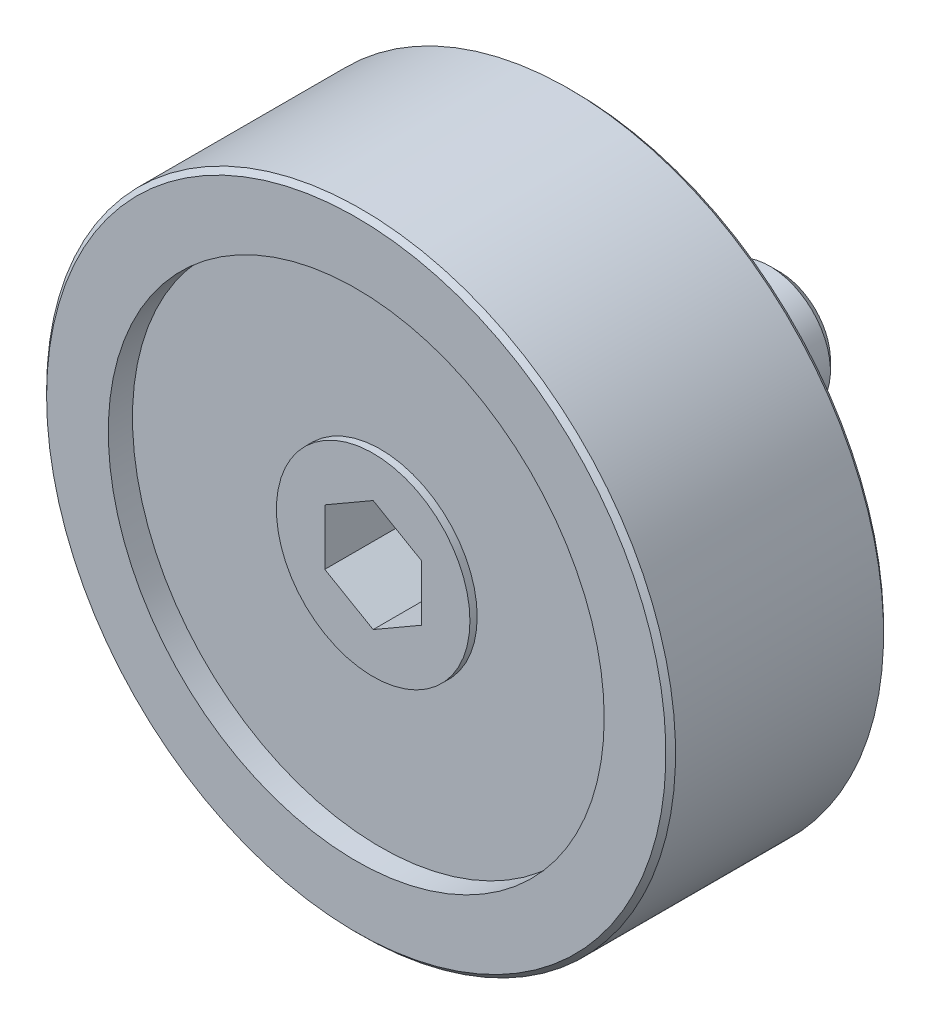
ISO-10303-21;
HEADER;
FILE_DESCRIPTION(('STEP AP214'),'2;1');
FILE_NAME('part.step','',(''),(''),'','','');
FILE_SCHEMA(('AUTOMOTIVE_DESIGN { 1 0 10303 214 1 1 1 1 }'));
ENDSEC;
DATA;
#1=APPLICATION_CONTEXT('core data for automotive mechanical design processes');
#2=APPLICATION_PROTOCOL_DEFINITION('international standard','automotive_design',2000,#1);
#3=PRODUCT_CONTEXT('',#1,'mechanical');
#4=PRODUCT('Part','Part','',(#3));
#5=PRODUCT_RELATED_PRODUCT_CATEGORY('part','',(#4));
#6=PRODUCT_DEFINITION_FORMATION('','',#4);
#7=PRODUCT_DEFINITION_CONTEXT('part definition',#1,'design');
#8=PRODUCT_DEFINITION('design','',#6,#7);
#9=PRODUCT_DEFINITION_SHAPE('','',#8);
#10=(LENGTH_UNIT() NAMED_UNIT(*) SI_UNIT(.MILLI.,.METRE.));
#11=(NAMED_UNIT(*) PLANE_ANGLE_UNIT() SI_UNIT($,.RADIAN.));
#12=(NAMED_UNIT(*) SI_UNIT($,.STERADIAN.) SOLID_ANGLE_UNIT());
#13=UNCERTAINTY_MEASURE_WITH_UNIT(LENGTH_MEASURE(1.E-05),#10,'distance_accuracy_value','');
#14=(GEOMETRIC_REPRESENTATION_CONTEXT(3) GLOBAL_UNCERTAINTY_ASSIGNED_CONTEXT((#13)) GLOBAL_UNIT_ASSIGNED_CONTEXT((#10,
#11,#12)) REPRESENTATION_CONTEXT('',''));
#15=CARTESIAN_POINT('',(0.,0.,0.));
#16=DIRECTION('',(0.,0.,1.));
#17=DIRECTION('',(1.,0.,0.));
#18=AXIS2_PLACEMENT_3D('',#15,#16,#17);
#19=CARTESIAN_POINT('',(0.,0.,1.2));
#20=DIRECTION('',(0.,0.,-1.));
#21=DIRECTION('',(-1.,0.,0.));
#22=AXIS2_PLACEMENT_3D('',#19,#20,#21);
#23=CYLINDRICAL_SURFACE('',#22,2.5);
#24=CARTESIAN_POINT('',(0.,0.,-7.1));
#25=DIRECTION('',(0.,0.,-1.));
#26=DIRECTION('',(-1.,0.,0.));
#27=AXIS2_PLACEMENT_3D('',#24,#25,#26);
#28=CIRCLE('',#27,2.5);
#29=CARTESIAN_POINT('',(-2.5,0.,-7.1));
#30=VERTEX_POINT('',#29);
#31=EDGE_CURVE('E9',#30,#30,#28,.F.);
#32=ORIENTED_EDGE('',*,*,#31,.T.);
#33=EDGE_LOOP('',(#32));
#34=FACE_BOUND('',#33,.T.);
#35=CARTESIAN_POINT('',(0.,0.,-1.1));
#36=DIRECTION('',(0.,0.,1.));
#37=DIRECTION('',(1.,0.,0.));
#38=AXIS2_PLACEMENT_3D('',#35,#36,#37);
#39=CIRCLE('',#38,2.5);
#40=CARTESIAN_POINT('',(2.5,0.,-1.1));
#41=VERTEX_POINT('',#40);
#42=EDGE_CURVE('E76',#41,#41,#39,.T.);
#43=ORIENTED_EDGE('',*,*,#42,.F.);
#44=EDGE_LOOP('',(#43));
#45=FACE_BOUND('',#44,.T.);
#46=ADVANCED_FACE('F14',(#34,#45),#23,.T.);
#47=CARTESIAN_POINT('',(0.,0.,1.2));
#48=DIRECTION('',(0.,0.,-1.));
#49=DIRECTION('',(-1.,0.,0.));
#50=AXIS2_PLACEMENT_3D('',#47,#48,#49);
#51=CYLINDRICAL_SURFACE('',#50,5.);
#52=CARTESIAN_POINT('',(0.,0.,2.));
#53=DIRECTION('',(0.,0.,-1.));
#54=DIRECTION('',(-1.,0.,0.));
#55=AXIS2_PLACEMENT_3D('',#52,#53,#54);
#56=CIRCLE('',#55,5.);
#57=CARTESIAN_POINT('',(-5.,0.,2.));
#58=VERTEX_POINT('',#57);
#59=EDGE_CURVE('E112',#58,#58,#56,.F.);
#60=ORIENTED_EDGE('',*,*,#59,.F.);
#61=EDGE_LOOP('',(#60));
#62=FACE_BOUND('',#61,.T.);
#63=CARTESIAN_POINT('',(0.,0.,0.5));
#64=DIRECTION('',(0.,0.,-1.));
#65=DIRECTION('',(-1.,0.,0.));
#66=AXIS2_PLACEMENT_3D('',#63,#64,#65);
#67=CIRCLE('',#66,5.);
#68=CARTESIAN_POINT('',(-5.,0.,0.5));
#69=VERTEX_POINT('',#68);
#70=EDGE_CURVE('E109',#69,#69,#67,.T.);
#71=ORIENTED_EDGE('',*,*,#70,.F.);
#72=EDGE_LOOP('',(#71));
#73=FACE_BOUND('',#72,.T.);
#74=ADVANCED_FACE('F163',(#62,#73),#51,.T.);
#75=CARTESIAN_POINT('',(0.,14.8,10.));
#76=DIRECTION('',(0.,0.,1.));
#77=DIRECTION('',(1.,0.,0.));
#78=AXIS2_PLACEMENT_3D('',#75,#76,#77);
#79=PLANE('',#78);
#80=CARTESIAN_POINT('',(0.,0.,10.));
#81=DIRECTION('',(0.,0.,1.));
#82=DIRECTION('',(1.,0.,0.));
#83=AXIS2_PLACEMENT_3D('',#80,#81,#82);
#84=CIRCLE('',#83,10.25);
#85=CARTESIAN_POINT('',(10.25,0.,10.));
#86=VERTEX_POINT('',#85);
#87=EDGE_CURVE('E127',#86,#86,#84,.T.);
#88=ORIENTED_EDGE('',*,*,#87,.F.);
#89=EDGE_LOOP('',(#88));
#90=FACE_BOUND('',#89,.T.);
#91=CARTESIAN_POINT('',(0.,0.,9.99999999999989));
#92=DIRECTION('',(0.,0.,-1.));
#93=DIRECTION('',(-1.,0.,0.));
#94=AXIS2_PLACEMENT_3D('',#91,#92,#93);
#95=CIRCLE('',#94,12.8);
#96=CARTESIAN_POINT('',(-12.8,0.,9.99999999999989));
#97=VERTEX_POINT('',#96);
#98=EDGE_CURVE('E124',#97,#97,#95,.T.);
#99=ORIENTED_EDGE('',*,*,#98,.F.);
#100=EDGE_LOOP('',(#99));
#101=FACE_BOUND('',#100,.T.);
#102=ADVANCED_FACE('F169',(#90,#101),#79,.T.);
#103=CARTESIAN_POINT('',(0.,4.00000000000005,9.3));
#104=DIRECTION('',(0.,0.,1.));
#105=DIRECTION('',(1.,0.,0.));
#106=AXIS2_PLACEMENT_3D('',#103,#104,#105);
#107=PLANE('',#106);
#108=CARTESIAN_POINT('',(0.,0.,9.3));
#109=DIRECTION('',(0.,0.,1.));
#110=DIRECTION('',(1.,0.,0.));
#111=AXIS2_PLACEMENT_3D('',#108,#109,#110);
#112=CIRCLE('',#111,4.00000000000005);
#113=CARTESIAN_POINT('',(4.00000000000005,0.,9.3));
#114=VERTEX_POINT('',#113);
#115=EDGE_CURVE('E136',#114,#114,#112,.T.);
#116=ORIENTED_EDGE('',*,*,#115,.T.);
#117=EDGE_LOOP('',(#116));
#118=FACE_BOUND('',#117,.T.);
#119=DIRECTION('',(0.866025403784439,-0.5,0.));
#120=VECTOR('',#119,1.);
#121=CARTESIAN_POINT('',(-2.,-1.15470053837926,9.3));
#122=LINE('',#121,#120);
#123=CARTESIAN_POINT('',(-2.,-1.15470053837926,9.3));
#124=VERTEX_POINT('',#123);
#125=CARTESIAN_POINT('',(0.,-2.30940107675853,9.3));
#126=VERTEX_POINT('',#125);
#127=EDGE_CURVE('E71',#124,#126,#122,.T.);
#128=ORIENTED_EDGE('',*,*,#127,.F.);
#129=DIRECTION('',(0.,-1.,0.));
#130=VECTOR('',#129,1.);
#131=CARTESIAN_POINT('',(-2.,1.15470053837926,9.3));
#132=LINE('',#131,#130);
#133=CARTESIAN_POINT('',(-2.,1.15470053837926,9.3));
#134=VERTEX_POINT('',#133);
#135=EDGE_CURVE('E65',#134,#124,#132,.T.);
#136=ORIENTED_EDGE('',*,*,#135,.F.);
#137=DIRECTION('',(-0.866025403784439,-0.5,0.));
#138=VECTOR('',#137,1.);
#139=CARTESIAN_POINT('',(0.,2.30940107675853,9.3));
#140=LINE('',#139,#138);
#141=CARTESIAN_POINT('',(0.,2.30940107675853,9.3));
#142=VERTEX_POINT('',#141);
#143=EDGE_CURVE('E68',#142,#134,#140,.T.);
#144=ORIENTED_EDGE('',*,*,#143,.F.);
#145=DIRECTION('',(-0.866025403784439,0.5,0.));
#146=VECTOR('',#145,1.);
#147=CARTESIAN_POINT('',(2.,1.15470053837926,9.3));
#148=LINE('',#147,#146);
#149=CARTESIAN_POINT('',(2.,1.15470053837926,9.3));
#150=VERTEX_POINT('',#149);
#151=EDGE_CURVE('E85',#150,#142,#148,.T.);
#152=ORIENTED_EDGE('',*,*,#151,.F.);
#153=DIRECTION('',(0.,1.,0.));
#154=VECTOR('',#153,1.);
#155=CARTESIAN_POINT('',(2.,-1.15470053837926,9.3));
#156=LINE('',#155,#154);
#157=CARTESIAN_POINT('',(2.,-1.15470053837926,9.3));
#158=VERTEX_POINT('',#157);
#159=EDGE_CURVE('E410',#158,#150,#156,.T.);
#160=ORIENTED_EDGE('',*,*,#159,.F.);
#161=DIRECTION('',(0.866025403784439,0.5,0.));
#162=VECTOR('',#161,1.);
#163=CARTESIAN_POINT('',(0.,-2.30940107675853,9.3));
#164=LINE('',#163,#162);
#165=EDGE_CURVE('E412',#126,#158,#164,.T.);
#166=ORIENTED_EDGE('',*,*,#165,.F.);
#167=EDGE_LOOP('',(#128,#136,#144,#152,#160,#166));
#168=FACE_BOUND('',#167,.T.);
#169=ADVANCED_FACE('F67',(#118,#168),#107,.T.);
#170=CARTESIAN_POINT('',(0.,0.,13.));
#171=DIRECTION('',(0.,0.,1.));
#172=DIRECTION('',(1.,0.,0.));
#173=AXIS2_PLACEMENT_3D('',#170,#171,#172);
#174=CYLINDRICAL_SURFACE('',#173,4.00000000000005);
#175=CARTESIAN_POINT('',(0.,0.,9.));
#176=DIRECTION('',(0.,0.,1.));
#177=DIRECTION('',(1.,0.,0.));
#178=AXIS2_PLACEMENT_3D('',#175,#176,#177);
#179=CIRCLE('',#178,4.00000000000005);
#180=CARTESIAN_POINT('',(4.00000000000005,0.,9.));
#181=VERTEX_POINT('',#180);
#182=EDGE_CURVE('E133',#181,#181,#179,.T.);
#183=ORIENTED_EDGE('',*,*,#182,.T.);
#184=EDGE_LOOP('',(#183));
#185=FACE_BOUND('',#184,.T.);
#186=ORIENTED_EDGE('',*,*,#115,.F.);
#187=EDGE_LOOP('',(#186));
#188=FACE_BOUND('',#187,.T.);
#189=ADVANCED_FACE('F193',(#185,#188),#174,.T.);
#190=CARTESIAN_POINT('',(0.,10.25,9.));
#191=DIRECTION('',(0.,0.,1.));
#192=DIRECTION('',(1.,0.,0.));
#193=AXIS2_PLACEMENT_3D('',#190,#191,#192);
#194=PLANE('',#193);
#195=CARTESIAN_POINT('',(0.,0.,9.));
#196=DIRECTION('',(0.,0.,1.));
#197=DIRECTION('',(1.,0.,0.));
#198=AXIS2_PLACEMENT_3D('',#195,#196,#197);
#199=CIRCLE('',#198,10.25);
#200=CARTESIAN_POINT('',(10.25,0.,9.));
#201=VERTEX_POINT('',#200);
#202=EDGE_CURVE('E130',#201,#201,#199,.T.);
#203=ORIENTED_EDGE('',*,*,#202,.T.);
#204=EDGE_LOOP('',(#203));
#205=FACE_BOUND('',#204,.T.);
#206=ORIENTED_EDGE('',*,*,#182,.F.);
#207=EDGE_LOOP('',(#206));
#208=FACE_BOUND('',#207,.T.);
#209=ADVANCED_FACE('F189',(#205,#208),#194,.T.);
#210=CARTESIAN_POINT('',(0.,0.,13.));
#211=DIRECTION('',(0.,0.,1.));
#212=DIRECTION('',(1.,0.,0.));
#213=AXIS2_PLACEMENT_3D('',#210,#211,#212);
#214=CYLINDRICAL_SURFACE('',#213,10.25);
#215=ORIENTED_EDGE('',*,*,#87,.T.);
#216=EDGE_LOOP('',(#215));
#217=FACE_BOUND('',#216,.T.);
#218=ORIENTED_EDGE('',*,*,#202,.F.);
#219=EDGE_LOOP('',(#218));
#220=FACE_BOUND('',#219,.T.);
#221=ADVANCED_FACE('F186',(#217,#220),#214,.F.);
#222=CARTESIAN_POINT('',(0.,0.,9.99999999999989));
#223=DIRECTION('',(0.,0.,-1.));
#224=DIRECTION('',(-1.,0.,0.));
#225=AXIS2_PLACEMENT_3D('',#222,#223,#224);
#226=CONICAL_SURFACE('',#225,12.8,0.785398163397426);
#227=CARTESIAN_POINT('',(0.,0.,9.79999999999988));
#228=DIRECTION('',(0.,0.,-1.));
#229=DIRECTION('',(-1.,0.,0.));
#230=AXIS2_PLACEMENT_3D('',#227,#228,#229);
#231=CIRCLE('',#230,13.);
#232=CARTESIAN_POINT('',(-13.,0.,9.79999999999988));
#233=VERTEX_POINT('',#232);
#234=EDGE_CURVE('E121',#233,#233,#231,.T.);
#235=ORIENTED_EDGE('',*,*,#234,.F.);
#236=EDGE_LOOP('',(#235));
#237=FACE_BOUND('',#236,.T.);
#238=ORIENTED_EDGE('',*,*,#98,.T.);
#239=EDGE_LOOP('',(#238));
#240=FACE_BOUND('',#239,.T.);
#241=ADVANCED_FACE('F175',(#237,#240),#226,.T.);
#242=CARTESIAN_POINT('',(0.,0.,1.2));
#243=DIRECTION('',(0.,0.,-1.));
#244=DIRECTION('',(-1.,0.,0.));
#245=AXIS2_PLACEMENT_3D('',#242,#243,#244);
#246=CYLINDRICAL_SURFACE('',#245,13.);
#247=CARTESIAN_POINT('',(0.,0.,1.2));
#248=DIRECTION('',(0.,0.,-1.));
#249=DIRECTION('',(-1.,0.,0.));
#250=AXIS2_PLACEMENT_3D('',#247,#248,#249);
#251=CIRCLE('',#250,13.);
#252=CARTESIAN_POINT('',(-13.,0.,1.2));
#253=VERTEX_POINT('',#252);
#254=EDGE_CURVE('E118',#253,#253,#251,.T.);
#255=ORIENTED_EDGE('',*,*,#254,.F.);
#256=EDGE_LOOP('',(#255));
#257=FACE_BOUND('',#256,.T.);
#258=ORIENTED_EDGE('',*,*,#234,.T.);
#259=EDGE_LOOP('',(#258));
#260=FACE_BOUND('',#259,.T.);
#261=ADVANCED_FACE('F222',(#257,#260),#246,.T.);
#262=CARTESIAN_POINT('',(0.,0.,1.2));
#263=DIRECTION('',(0.,0.,1.));
#264=DIRECTION('',(1.,0.,0.));
#265=AXIS2_PLACEMENT_3D('',#262,#263,#264);
#266=CONICAL_SURFACE('',#265,13.,0.785398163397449);
#267=CARTESIAN_POINT('',(0.,0.,1.));
#268=DIRECTION('',(0.,0.,-1.));
#269=DIRECTION('',(-1.,0.,0.));
#270=AXIS2_PLACEMENT_3D('',#267,#268,#269);
#271=CIRCLE('',#270,12.8);
#272=CARTESIAN_POINT('',(-12.8,0.,1.));
#273=VERTEX_POINT('',#272);
#274=EDGE_CURVE('E115',#273,#273,#271,.T.);
#275=ORIENTED_EDGE('',*,*,#274,.F.);
#276=EDGE_LOOP('',(#275));
#277=FACE_BOUND('',#276,.T.);
#278=ORIENTED_EDGE('',*,*,#254,.T.);
#279=EDGE_LOOP('',(#278));
#280=FACE_BOUND('',#279,.T.);
#281=ADVANCED_FACE('F205',(#277,#280),#266,.T.);
#282=CARTESIAN_POINT('',(0.,5.1,2.));
#283=DIRECTION('',(0.,0.,-1.));
#284=DIRECTION('',(-1.,0.,0.));
#285=AXIS2_PLACEMENT_3D('',#282,#283,#284);
#286=PLANE('',#285);
#287=CARTESIAN_POINT('',(0.,0.,2.));
#288=DIRECTION('',(0.,0.,1.));
#289=DIRECTION('',(1.,0.,0.));
#290=AXIS2_PLACEMENT_3D('',#287,#288,#289);
#291=CIRCLE('',#290,10.25);
#292=CARTESIAN_POINT('',(10.25,0.,2.));
#293=VERTEX_POINT('',#292);
#294=EDGE_CURVE('E139',#293,#293,#291,.T.);
#295=ORIENTED_EDGE('',*,*,#294,.F.);
#296=EDGE_LOOP('',(#295));
#297=FACE_BOUND('',#296,.T.);
#298=ORIENTED_EDGE('',*,*,#59,.T.);
#299=EDGE_LOOP('',(#298));
#300=FACE_BOUND('',#299,.T.);
#301=ADVANCED_FACE('F201',(#297,#300),#286,.T.);
#302=CARTESIAN_POINT('',(0.,0.,13.));
#303=DIRECTION('',(0.,0.,1.));
#304=DIRECTION('',(1.,0.,0.));
#305=AXIS2_PLACEMENT_3D('',#302,#303,#304);
#306=CYLINDRICAL_SURFACE('',#305,10.25);
#307=ORIENTED_EDGE('',*,*,#294,.T.);
#308=EDGE_LOOP('',(#307));
#309=FACE_BOUND('',#308,.T.);
#310=CARTESIAN_POINT('',(0.,0.,1.));
#311=DIRECTION('',(0.,0.,1.));
#312=DIRECTION('',(1.,0.,0.));
#313=AXIS2_PLACEMENT_3D('',#310,#311,#312);
#314=CIRCLE('',#313,10.25);
#315=CARTESIAN_POINT('',(10.25,0.,1.));
#316=VERTEX_POINT('',#315);
#317=EDGE_CURVE('E142',#316,#316,#314,.T.);
#318=ORIENTED_EDGE('',*,*,#317,.F.);
#319=EDGE_LOOP('',(#318));
#320=FACE_BOUND('',#319,.T.);
#321=ADVANCED_FACE('F204',(#309,#320),#306,.F.);
#322=CARTESIAN_POINT('',(0.,14.8,1.));
#323=DIRECTION('',(0.,0.,-1.));
#324=DIRECTION('',(-1.,0.,0.));
#325=AXIS2_PLACEMENT_3D('',#322,#323,#324);
#326=PLANE('',#325);
#327=ORIENTED_EDGE('',*,*,#317,.T.);
#328=EDGE_LOOP('',(#327));
#329=FACE_BOUND('',#328,.T.);
#330=ORIENTED_EDGE('',*,*,#274,.T.);
#331=EDGE_LOOP('',(#330));
#332=FACE_BOUND('',#331,.T.);
#333=ADVANCED_FACE('F209',(#329,#332),#326,.T.);
#334=CARTESIAN_POINT('',(0.,0.,0.5));
#335=DIRECTION('',(0.,0.,-1.));
#336=DIRECTION('',(-1.,0.,0.));
#337=AXIS2_PLACEMENT_3D('',#334,#335,#336);
#338=PLANE('',#337);
#339=CARTESIAN_POINT('',(0.,0.,0.5));
#340=DIRECTION('',(0.,0.,-1.));
#341=DIRECTION('',(-1.,0.,0.));
#342=AXIS2_PLACEMENT_3D('',#339,#340,#341);
#343=CIRCLE('',#342,2.);
#344=CARTESIAN_POINT('',(-2.,0.,0.5));
#345=VERTEX_POINT('',#344);
#346=EDGE_CURVE('E106',#345,#345,#343,.T.);
#347=ORIENTED_EDGE('',*,*,#346,.F.);
#348=EDGE_LOOP('',(#347));
#349=FACE_BOUND('',#348,.T.);
#350=ORIENTED_EDGE('',*,*,#70,.T.);
#351=EDGE_LOOP('',(#350));
#352=FACE_BOUND('',#351,.T.);
#353=ADVANCED_FACE('F180',(#349,#352),#338,.T.);
#354=CARTESIAN_POINT('',(0.,0.,1.2));
#355=DIRECTION('',(0.,0.,-1.));
#356=DIRECTION('',(-1.,0.,0.));
#357=AXIS2_PLACEMENT_3D('',#354,#355,#356);
#358=CYLINDRICAL_SURFACE('',#357,2.);
#359=CARTESIAN_POINT('',(0.,0.,-1.1));
#360=DIRECTION('',(0.,0.,1.));
#361=DIRECTION('',(1.,0.,0.));
#362=AXIS2_PLACEMENT_3D('',#359,#360,#361);
#363=CIRCLE('',#362,2.);
#364=CARTESIAN_POINT('',(2.,0.,-1.1));
#365=VERTEX_POINT('',#364);
#366=EDGE_CURVE('E105',#365,#365,#363,.T.);
#367=ORIENTED_EDGE('',*,*,#366,.T.);
#368=EDGE_LOOP('',(#367));
#369=FACE_BOUND('',#368,.T.);
#370=ORIENTED_EDGE('',*,*,#346,.T.);
#371=EDGE_LOOP('',(#370));
#372=FACE_BOUND('',#371,.T.);
#373=ADVANCED_FACE('F177',(#369,#372),#358,.T.);
#374=CARTESIAN_POINT('',(0.,0.,-1.1));
#375=DIRECTION('',(0.,0.,1.));
#376=DIRECTION('',(1.,0.,0.));
#377=AXIS2_PLACEMENT_3D('',#374,#375,#376);
#378=PLANE('',#377);
#379=ORIENTED_EDGE('',*,*,#366,.F.);
#380=EDGE_LOOP('',(#379));
#381=FACE_BOUND('',#380,.T.);
#382=ORIENTED_EDGE('',*,*,#42,.T.);
#383=EDGE_LOOP('',(#382));
#384=FACE_BOUND('',#383,.T.);
#385=ADVANCED_FACE('F159',(#381,#384),#378,.T.);
#386=CARTESIAN_POINT('',(0.,0.,-7.5));
#387=DIRECTION('',(0.,0.,-1.));
#388=DIRECTION('',(-1.,0.,0.));
#389=AXIS2_PLACEMENT_3D('',#386,#387,#388);
#390=PLANE('',#389);
#391=CARTESIAN_POINT('',(0.,0.,-7.5));
#392=DIRECTION('',(0.,0.,-1.));
#393=DIRECTION('',(-1.,0.,0.));
#394=AXIS2_PLACEMENT_3D('',#391,#392,#393);
#395=CIRCLE('',#394,2.1);
#396=CARTESIAN_POINT('',(-2.1,0.,-7.5));
#397=VERTEX_POINT('',#396);
#398=EDGE_CURVE('E22',#397,#397,#395,.T.);
#399=ORIENTED_EDGE('',*,*,#398,.T.);
#400=EDGE_LOOP('',(#399));
#401=FACE_BOUND('',#400,.T.);
#402=ADVANCED_FACE('F149',(#401),#390,.T.);
#403=CARTESIAN_POINT('',(0.,0.,-7.5));
#404=DIRECTION('',(0.,0.,1.));
#405=DIRECTION('',(1.,0.,0.));
#406=AXIS2_PLACEMENT_3D('',#403,#404,#405);
#407=CONICAL_SURFACE('',#406,2.1,0.785398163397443);
#408=ORIENTED_EDGE('',*,*,#31,.F.);
#409=EDGE_LOOP('',(#408));
#410=FACE_BOUND('',#409,.T.);
#411=ORIENTED_EDGE('',*,*,#398,.F.);
#412=EDGE_LOOP('',(#411));
#413=FACE_BOUND('',#412,.T.);
#414=ADVANCED_FACE('F16',(#410,#413),#407,.T.);
#415=CARTESIAN_POINT('',(-2.,1.15470053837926,16.9376261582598));
#416=DIRECTION('',(1.,0.,0.));
#417=DIRECTION('',(0.,0.,-1.));
#418=AXIS2_PLACEMENT_3D('',#415,#416,#417);
#419=PLANE('',#418);
#420=DIRECTION('',(0.,0.,-1.));
#421=VECTOR('',#420,1.);
#422=CARTESIAN_POINT('',(-2.,1.15470053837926,16.9376261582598));
#423=LINE('',#422,#421);
#424=CARTESIAN_POINT('',(-2.,1.15470053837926,5.8));
#425=VERTEX_POINT('',#424);
#426=EDGE_CURVE('E81',#134,#425,#423,.T.);
#427=ORIENTED_EDGE('',*,*,#426,.F.);
#428=ORIENTED_EDGE('',*,*,#135,.T.);
#429=DIRECTION('',(0.,0.,-1.));
#430=VECTOR('',#429,1.);
#431=CARTESIAN_POINT('',(-2.,-1.15470053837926,16.9376261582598));
#432=LINE('',#431,#430);
#433=CARTESIAN_POINT('',(-2.,-1.15470053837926,5.8));
#434=VERTEX_POINT('',#433);
#435=EDGE_CURVE('E89',#124,#434,#432,.T.);
#436=ORIENTED_EDGE('',*,*,#435,.T.);
#437=DIRECTION('',(0.,-1.,0.));
#438=VECTOR('',#437,1.);
#439=CARTESIAN_POINT('',(-2.,1.15470053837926,5.8));
#440=LINE('',#439,#438);
#441=EDGE_CURVE('E88',#425,#434,#440,.T.);
#442=ORIENTED_EDGE('',*,*,#441,.F.);
#443=EDGE_LOOP('',(#427,#428,#436,#442));
#444=FACE_BOUND('',#443,.T.);
#445=ADVANCED_FACE('F87',(#444),#419,.T.);
#446=CARTESIAN_POINT('',(0.,2.30940107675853,16.9376261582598));
#447=DIRECTION('',(0.5,-0.866025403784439,0.));
#448=DIRECTION('',(0.866025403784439,0.5,0.));
#449=AXIS2_PLACEMENT_3D('',#446,#447,#448);
#450=PLANE('',#449);
#451=DIRECTION('',(0.,0.,-1.));
#452=VECTOR('',#451,1.);
#453=CARTESIAN_POINT('',(0.,2.30940107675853,16.9376261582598));
#454=LINE('',#453,#452);
#455=CARTESIAN_POINT('',(0.,2.30940107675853,5.8));
#456=VERTEX_POINT('',#455);
#457=EDGE_CURVE('E83',#142,#456,#454,.T.);
#458=ORIENTED_EDGE('',*,*,#457,.F.);
#459=ORIENTED_EDGE('',*,*,#143,.T.);
#460=ORIENTED_EDGE('',*,*,#426,.T.);
#461=DIRECTION('',(-0.866025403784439,-0.5,0.));
#462=VECTOR('',#461,1.);
#463=CARTESIAN_POINT('',(0.,2.30940107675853,5.8));
#464=LINE('',#463,#462);
#465=EDGE_CURVE('E29',#456,#425,#464,.T.);
#466=ORIENTED_EDGE('',*,*,#465,.F.);
#467=EDGE_LOOP('',(#458,#459,#460,#466));
#468=FACE_BOUND('',#467,.T.);
#469=ADVANCED_FACE('F80',(#468),#450,.T.);
#470=CARTESIAN_POINT('',(2.,1.15470053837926,16.9376261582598));
#471=DIRECTION('',(-0.5,-0.866025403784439,0.));
#472=DIRECTION('',(0.866025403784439,-0.5,0.));
#473=AXIS2_PLACEMENT_3D('',#470,#471,#472);
#474=PLANE('',#473);
#475=DIRECTION('',(0.,0.,-1.));
#476=VECTOR('',#475,1.);
#477=CARTESIAN_POINT('',(2.,1.15470053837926,16.9376261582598));
#478=LINE('',#477,#476);
#479=CARTESIAN_POINT('',(2.,1.15470053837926,5.8));
#480=VERTEX_POINT('',#479);
#481=EDGE_CURVE('E91',#150,#480,#478,.T.);
#482=ORIENTED_EDGE('',*,*,#481,.F.);
#483=ORIENTED_EDGE('',*,*,#151,.T.);
#484=ORIENTED_EDGE('',*,*,#457,.T.);
#485=DIRECTION('',(-0.866025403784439,0.5,0.));
#486=VECTOR('',#485,1.);
#487=CARTESIAN_POINT('',(2.,1.15470053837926,5.8));
#488=LINE('',#487,#486);
#489=EDGE_CURVE('E34',#480,#456,#488,.T.);
#490=ORIENTED_EDGE('',*,*,#489,.F.);
#491=EDGE_LOOP('',(#482,#483,#484,#490));
#492=FACE_BOUND('',#491,.T.);
#493=ADVANCED_FACE('F253',(#492),#474,.T.);
#494=CARTESIAN_POINT('',(2.,-1.15470053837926,16.9376261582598));
#495=DIRECTION('',(-1.,0.,0.));
#496=DIRECTION('',(0.,-1.,0.));
#497=AXIS2_PLACEMENT_3D('',#494,#495,#496);
#498=PLANE('',#497);
#499=DIRECTION('',(0.,0.,-1.));
#500=VECTOR('',#499,1.);
#501=CARTESIAN_POINT('',(2.,-1.15470053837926,16.9376261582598));
#502=LINE('',#501,#500);
#503=CARTESIAN_POINT('',(2.,-1.15470053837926,5.8));
#504=VERTEX_POINT('',#503);
#505=EDGE_CURVE('E98',#158,#504,#502,.T.);
#506=ORIENTED_EDGE('',*,*,#505,.F.);
#507=ORIENTED_EDGE('',*,*,#159,.T.);
#508=ORIENTED_EDGE('',*,*,#481,.T.);
#509=DIRECTION('',(0.,1.,0.));
#510=VECTOR('',#509,1.);
#511=CARTESIAN_POINT('',(2.,-1.15470053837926,5.8));
#512=LINE('',#511,#510);
#513=EDGE_CURVE('E422',#504,#480,#512,.T.);
#514=ORIENTED_EDGE('',*,*,#513,.F.);
#515=EDGE_LOOP('',(#506,#507,#508,#514));
#516=FACE_BOUND('',#515,.T.);
#517=ADVANCED_FACE('F249',(#516),#498,.T.);
#518=CARTESIAN_POINT('',(0.,-2.30940107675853,16.9376261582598));
#519=DIRECTION('',(-0.5,0.866025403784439,0.));
#520=DIRECTION('',(-0.866025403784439,-0.5,0.));
#521=AXIS2_PLACEMENT_3D('',#518,#519,#520);
#522=PLANE('',#521);
#523=DIRECTION('',(0.,0.,-1.));
#524=VECTOR('',#523,1.);
#525=CARTESIAN_POINT('',(0.,-2.30940107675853,16.9376261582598));
#526=LINE('',#525,#524);
#527=CARTESIAN_POINT('',(0.,-2.30940107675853,5.8));
#528=VERTEX_POINT('',#527);
#529=EDGE_CURVE('E77',#126,#528,#526,.T.);
#530=ORIENTED_EDGE('',*,*,#529,.F.);
#531=ORIENTED_EDGE('',*,*,#165,.T.);
#532=ORIENTED_EDGE('',*,*,#505,.T.);
#533=DIRECTION('',(0.866025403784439,0.5,0.));
#534=VECTOR('',#533,1.);
#535=CARTESIAN_POINT('',(0.,-2.30940107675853,5.8));
#536=LINE('',#535,#534);
#537=EDGE_CURVE('E420',#528,#504,#536,.T.);
#538=ORIENTED_EDGE('',*,*,#537,.F.);
#539=EDGE_LOOP('',(#530,#531,#532,#538));
#540=FACE_BOUND('',#539,.T.);
#541=ADVANCED_FACE('F245',(#540),#522,.T.);
#542=CARTESIAN_POINT('',(-2.,-1.15470053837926,16.9376261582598));
#543=DIRECTION('',(0.5,0.866025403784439,0.));
#544=DIRECTION('',(-0.866025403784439,0.5,0.));
#545=AXIS2_PLACEMENT_3D('',#542,#543,#544);
#546=PLANE('',#545);
#547=ORIENTED_EDGE('',*,*,#435,.F.);
#548=ORIENTED_EDGE('',*,*,#127,.T.);
#549=ORIENTED_EDGE('',*,*,#529,.T.);
#550=DIRECTION('',(0.866025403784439,-0.5,0.));
#551=VECTOR('',#550,1.);
#552=CARTESIAN_POINT('',(-2.,-1.15470053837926,5.8));
#553=LINE('',#552,#551);
#554=EDGE_CURVE('E418',#434,#528,#553,.T.);
#555=ORIENTED_EDGE('',*,*,#554,.F.);
#556=EDGE_LOOP('',(#547,#548,#549,#555));
#557=FACE_BOUND('',#556,.T.);
#558=ADVANCED_FACE('F185',(#557),#546,.T.);
#559=CARTESIAN_POINT('',(0.,0.,5.8));
#560=DIRECTION('',(0.,0.,1.));
#561=DIRECTION('',(1.,0.,0.));
#562=AXIS2_PLACEMENT_3D('',#559,#560,#561);
#563=PLANE('',#562);
#564=ORIENTED_EDGE('',*,*,#441,.T.);
#565=ORIENTED_EDGE('',*,*,#554,.T.);
#566=ORIENTED_EDGE('',*,*,#537,.T.);
#567=ORIENTED_EDGE('',*,*,#513,.T.);
#568=ORIENTED_EDGE('',*,*,#489,.T.);
#569=ORIENTED_EDGE('',*,*,#465,.T.);
#570=EDGE_LOOP('',(#564,#565,#566,#567,#568,#569));
#571=FACE_BOUND('',#570,.T.);
#572=ADVANCED_FACE('F182',(#571),#563,.T.);
#573=CLOSED_SHELL('',(#46,#74,#102,#169,#189,#209,#221,#241,#261,#281,#301,#321,#333,#353,#373,
#385,#402,#414,#445,#469,#493,#517,#541,#558,#572));
#574=MANIFOLD_SOLID_BREP('B1',#573);
#575=ADVANCED_BREP_SHAPE_REPRESENTATION('',(#18,#574),#14);
#576=SHAPE_DEFINITION_REPRESENTATION(#9,#575);
ENDSEC;
END-ISO-10303-21;
